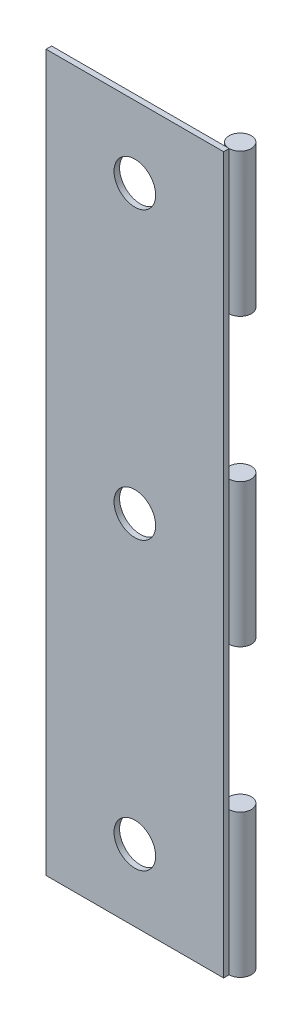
from build123d import *

# Parameters (mm, degrees)
SKETCH2_R                      = 1
BOSS_EXTRUDE1_DEPTH            = 64.5
CUT_EXTRUDE1_REACH             = 66.516
SKETCH3_W                      = 6.095078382
SKETCH3_H                      = 12.9
CUT_EXTRUDE1_DIRECTION_2_REACH = 66.516
SKETCH4_W                      = 16
SKETCH4_H                      = 0.5
BOSS_EXTRUDE2_DEPTH            = 64.5
SKETCH5_R                      = 1.875
CUT_EXTRUDE2_DEPTH             = 0.5


with BuildPart() as part:
    # Sketch2 → Boss-Extrude1 (new body)
    with BuildSketch(Plane(origin=(0, 0, 0), x_dir=(1, 0, 0), z_dir=(0, 1, 0))):
        with Locations(Location((0, 0, 0), (0, 0, 270))):
            Circle(SKETCH2_R)
    extrude(amount=BOSS_EXTRUDE1_DEPTH)

    # Sketch3 → Cut-Extrude1 (cut, up to next)
    with BuildSketch(Plane.XY, mode=Mode.PRIVATE) as cut_extrude1_sk1:
        with Locations((0.042923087, 45.15)):
            Rectangle(SKETCH3_W, SKETCH3_H)
    cut_extrude1_tool1 = extrude(cut_extrude1_sk1.sketch, amount=-CUT_EXTRUDE1_REACH, mode=Mode.PRIVATE) & part.part
    # Sketch3 → Cut-Extrude1 (cut, up to next)
    with BuildSketch(Plane.XY, mode=Mode.PRIVATE) as cut_extrude1_sk2:
        with Locations((0.042923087, 19.35)):
            Rectangle(SKETCH3_W, SKETCH3_H)
    cut_extrude1_tool2 = extrude(cut_extrude1_sk2.sketch, amount=-CUT_EXTRUDE1_REACH, mode=Mode.PRIVATE) & part.part
    add(cut_extrude1_tool1.solids().sort_by_distance((0.042923, 45.15, 0))[0], mode=Mode.SUBTRACT)
    add(cut_extrude1_tool2.solids().sort_by_distance((0.042923, 19.35, 0))[0], mode=Mode.SUBTRACT)

    # Sketch3 → Cut-Extrude1 direction 2 (cut, up to next)
    with BuildSketch(Plane.XY, mode=Mode.PRIVATE) as cut_extrude1_direction_2_sk1:
        with Locations((0.042923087, 45.15)):
            Rectangle(SKETCH3_W, SKETCH3_H)
    cut_extrude1_direction_2_tool1 = extrude(cut_extrude1_direction_2_sk1.sketch, amount=CUT_EXTRUDE1_DIRECTION_2_REACH, mode=Mode.PRIVATE) & part.part
    # Sketch3 → Cut-Extrude1 direction 2 (cut, up to next)
    with BuildSketch(Plane.XY, mode=Mode.PRIVATE) as cut_extrude1_direction_2_sk2:
        with Locations((0.042923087, 19.35)):
            Rectangle(SKETCH3_W, SKETCH3_H)
    cut_extrude1_direction_2_tool2 = extrude(cut_extrude1_direction_2_sk2.sketch, amount=CUT_EXTRUDE1_DIRECTION_2_REACH, mode=Mode.PRIVATE) & part.part
    add(cut_extrude1_direction_2_tool1.solids().sort_by_distance((0.042923, 45.15, 0))[0], mode=Mode.SUBTRACT)
    add(cut_extrude1_direction_2_tool2.solids().sort_by_distance((0.042923, 19.35, 0))[0], mode=Mode.SUBTRACT)


with BuildPart() as cut_extrude1_piece_1:
    # of the separate pieces the step leaves, piece 1, a body of its own (cut_extrude1_pieces)
    add(part.part.solids().sort_by_distance((0, 25.8, 1))[0])


with BuildPart() as cut_extrude1_piece_2:
    # of the separate pieces the step leaves, piece 2, a body of its own (cut_extrude1_pieces)
    add(part.part.solids().sort_by_distance((0, 51.6, 1))[0])


with BuildPart() as cut_extrude1_piece_3:
    # of the separate pieces the step leaves, piece 3, a body of its own (cut_extrude1_pieces)
    add(part.part.solids().sort_by_distance((0, 0, 1))[0])


with BuildPart() as body_4:
    # Sketch4 → Boss-Extrude2 (new body)
    with BuildSketch(Plane(origin=(0, 0, 0), x_dir=(-1, 0, 0), z_dir=(0, -1, 0))):
        with Locations((8, -1.25)):
            Rectangle(SKETCH4_W, SKETCH4_H)
    extrude(amount=-BOSS_EXTRUDE2_DEPTH)

    # Sketch5 → Cut-Extrude2 (cut)
    with BuildSketch(Plane(origin=(0, 0, 1), x_dir=(-1, 0, 0), z_dir=(0, 0, -1))):
        with Locations((8, 32.25)):
            Circle(SKETCH5_R)
        with Locations((8, 6.45)):
            Circle(SKETCH5_R)
        with Locations((8, 58.047652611)):
            Circle(SKETCH5_R)
    extrude(amount=-CUT_EXTRUDE2_DEPTH, mode=Mode.SUBTRACT)


solid = Compound([cut_extrude1_piece_1.part, cut_extrude1_piece_2.part, cut_extrude1_piece_3.part, body_4.part])
